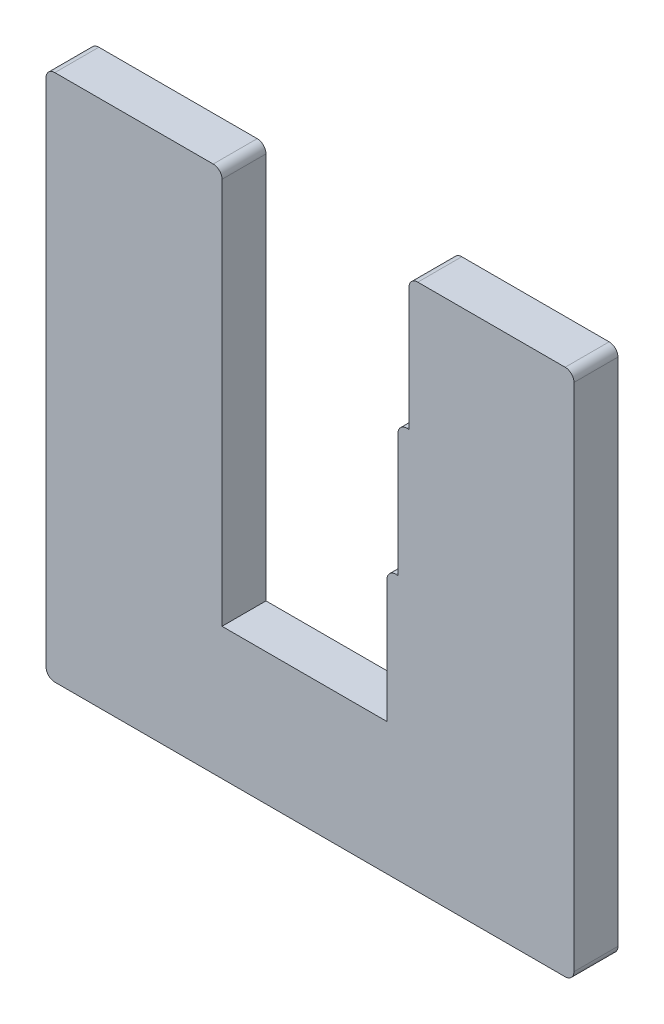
from build123d import *

# Parameters (mm, degrees)
ESQUISSE1_W             = 120
ESQUISSE1_H             = 120
BOSS_EXTRU_1_DEPTH      = 10
ESQUISSE2_W             = 42.5
ESQUISSE2_H             = 30
ENL_V_MAT_EXTRU_1_DEPTH = 10
ESQUISSE3_W             = 40
ESQUISSE3_H             = 30
ENL_V_MAT_EXTRU_2_DEPTH = 10
ESQUISSE4_W             = 37.5
ESQUISSE4_H             = 30
ENL_V_MAT_EXTRU_3_DEPTH = 10
CONG_1_R                = 2


with BuildPart() as part:
    # Esquisse1 → Boss.-Extru.1 (new body)
    with BuildSketch(Plane.XY):
        with Locations((60, 60)):
            Rectangle(ESQUISSE1_W, ESQUISSE1_H)
    extrude(amount=BOSS_EXTRU_1_DEPTH)

    # Esquisse2 → Enl_v. mat.-Extru.1 (cut)
    with BuildSketch(Plane.XY.offset(10)):
        with Locations((61.25, 105)):
            Rectangle(ESQUISSE2_W, ESQUISSE2_H)
    extrude(amount=-ENL_V_MAT_EXTRU_1_DEPTH, mode=Mode.SUBTRACT)

    # Esquisse3 → Enl_v. mat.-Extru.2 (cut)
    with BuildSketch(Plane.XY.offset(10)):
        with Locations((60, 75)):
            Rectangle(ESQUISSE3_W, ESQUISSE3_H)
    extrude(amount=-ENL_V_MAT_EXTRU_2_DEPTH, mode=Mode.SUBTRACT)

    # Esquisse4 → Enl_v. mat.-Extru.3 (cut)
    with BuildSketch(Plane.XY.offset(10)):
        with Locations((58.75, 45)):
            Rectangle(ESQUISSE4_W, ESQUISSE4_H)
    extrude(amount=-ENL_V_MAT_EXTRU_3_DEPTH, mode=Mode.SUBTRACT)

    # Cong_1
    cong_1_edges = [part.edges().sort_by_distance(p)[0] for p in [
        (40, 120, 5),
        (82.5, 120, 5),
        (80, 90, 5),
        (77.5, 60, 5),
        (0, 120, 5),
        (120, 120, 5),
        (120, 0, 5),
        (0, 0, 5),
    ]]
    fillet(cong_1_edges, radius=CONG_1_R)


solid = part.part
